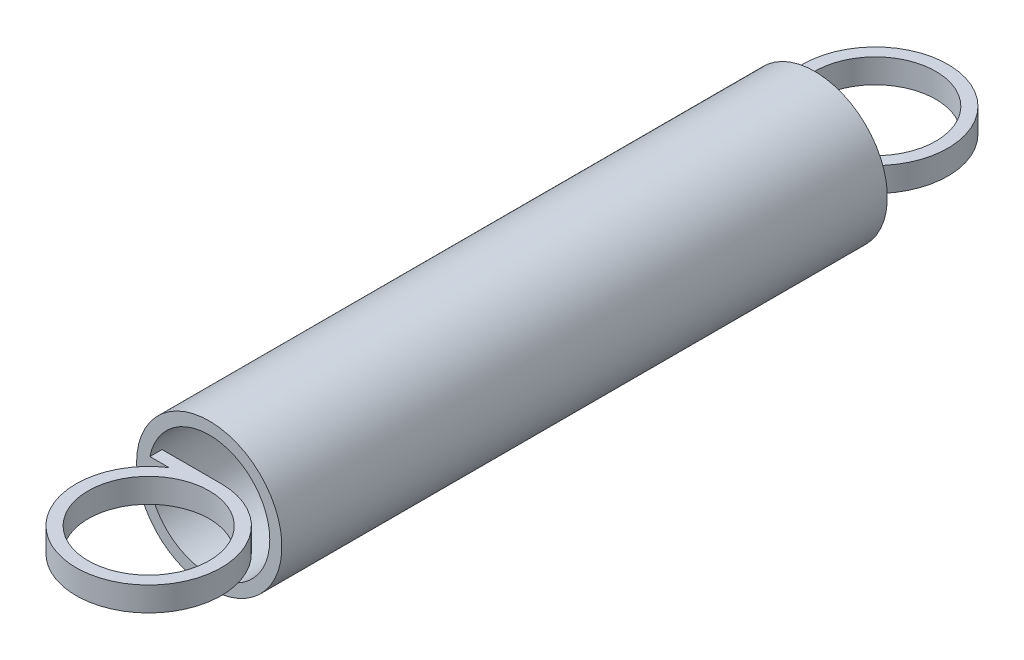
ISO-10303-21;
HEADER;
FILE_DESCRIPTION(('STEP AP214'),'2;1');
FILE_NAME('part.step','',(''),(''),'','','');
FILE_SCHEMA(('AUTOMOTIVE_DESIGN { 1 0 10303 214 1 1 1 1 }'));
ENDSEC;
DATA;
#1=APPLICATION_CONTEXT('core data for automotive mechanical design processes');
#2=APPLICATION_PROTOCOL_DEFINITION('international standard','automotive_design',2000,#1);
#3=PRODUCT_CONTEXT('',#1,'mechanical');
#4=PRODUCT('Part','Part','',(#3));
#5=PRODUCT_RELATED_PRODUCT_CATEGORY('part','',(#4));
#6=PRODUCT_DEFINITION_FORMATION('','',#4);
#7=PRODUCT_DEFINITION_CONTEXT('part definition',#1,'design');
#8=PRODUCT_DEFINITION('design','',#6,#7);
#9=PRODUCT_DEFINITION_SHAPE('','',#8);
#10=(LENGTH_UNIT() NAMED_UNIT(*) SI_UNIT(.MILLI.,.METRE.));
#11=(NAMED_UNIT(*) PLANE_ANGLE_UNIT() SI_UNIT($,.RADIAN.));
#12=(NAMED_UNIT(*) SI_UNIT($,.STERADIAN.) SOLID_ANGLE_UNIT());
#13=UNCERTAINTY_MEASURE_WITH_UNIT(LENGTH_MEASURE(1.E-05),#10,'distance_accuracy_value','');
#14=(GEOMETRIC_REPRESENTATION_CONTEXT(3) GLOBAL_UNCERTAINTY_ASSIGNED_CONTEXT((#13)) GLOBAL_UNIT_ASSIGNED_CONTEXT((#10,
#11,#12)) REPRESENTATION_CONTEXT('',''));
#15=CARTESIAN_POINT('',(0.,0.,0.));
#16=DIRECTION('',(0.,0.,1.));
#17=DIRECTION('',(1.,0.,0.));
#18=AXIS2_PLACEMENT_3D('',#15,#16,#17);
#19=CARTESIAN_POINT('',(0.,0.,12.5));
#20=DIRECTION('',(0.,0.,1.));
#21=DIRECTION('',(1.,0.,0.));
#22=AXIS2_PLACEMENT_3D('',#19,#20,#21);
#23=PLANE('',#22);
#24=DIRECTION('',(-1.,0.,0.));
#25=VECTOR('',#24,1.);
#26=CARTESIAN_POINT('',(-1.65831239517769,0.499999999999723,12.5));
#27=LINE('',#26,#25);
#28=CARTESIAN_POINT('',(-1.65831239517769,0.499999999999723,12.5));
#29=VERTEX_POINT('',#28);
#30=CARTESIAN_POINT('',(-2.44948974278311,0.499999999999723,12.4999999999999));
#31=VERTEX_POINT('',#30);
#32=EDGE_CURVE('E119',#29,#31,#27,.T.);
#33=ORIENTED_EDGE('',*,*,#32,.T.);
#34=CARTESIAN_POINT('',(0.,0.,12.5));
#35=DIRECTION('',(0.,0.,1.));
#36=DIRECTION('',(1.,0.,0.));
#37=AXIS2_PLACEMENT_3D('',#34,#35,#36);
#38=CIRCLE('',#37,2.5);
#39=CARTESIAN_POINT('',(-2.44948974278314,-0.499999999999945,12.5));
#40=VERTEX_POINT('',#39);
#41=EDGE_CURVE('E111',#40,#31,#38,.T.);
#42=ORIENTED_EDGE('',*,*,#41,.F.);
#43=DIRECTION('',(-1.,0.,0.));
#44=VECTOR('',#43,1.);
#45=CARTESIAN_POINT('',(-1.65831239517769,-0.499999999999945,12.5));
#46=LINE('',#45,#44);
#47=CARTESIAN_POINT('',(-1.65831239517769,-0.499999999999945,12.5));
#48=VERTEX_POINT('',#47);
#49=EDGE_CURVE('E45',#48,#40,#46,.T.);
#50=ORIENTED_EDGE('',*,*,#49,.F.);
#51=DIRECTION('',(0.,-1.,0.));
#52=VECTOR('',#51,1.);
#53=CARTESIAN_POINT('',(-1.65831239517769,0.499999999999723,12.5));
#54=LINE('',#53,#52);
#55=EDGE_CURVE('E96',#29,#48,#54,.T.);
#56=ORIENTED_EDGE('',*,*,#55,.F.);
#57=EDGE_LOOP('',(#33,#42,#50,#56));
#58=FACE_BOUND('',#57,.T.);
#59=CARTESIAN_POINT('',(0.,0.,12.5));
#60=DIRECTION('',(0.,0.,1.));
#61=DIRECTION('',(1.,0.,0.));
#62=AXIS2_PLACEMENT_3D('',#59,#60,#61);
#63=CIRCLE('',#62,3.);
#64=CARTESIAN_POINT('',(-2.99999999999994,0.,12.5));
#65=VERTEX_POINT('',#64);
#66=EDGE_CURVE('E159',#65,#65,#63,.T.);
#67=ORIENTED_EDGE('',*,*,#66,.T.);
#68=EDGE_LOOP('',(#67));
#69=FACE_BOUND('',#68,.T.);
#70=ADVANCED_FACE('F30',(#58,#69),#23,.T.);
#71=CARTESIAN_POINT('',(0.,0.,-12.5));
#72=DIRECTION('',(0.,0.,1.));
#73=DIRECTION('',(1.,0.,0.));
#74=AXIS2_PLACEMENT_3D('',#71,#72,#73);
#75=PLANE('',#74);
#76=CARTESIAN_POINT('',(0.,0.,-12.5));
#77=DIRECTION('',(0.,0.,1.));
#78=DIRECTION('',(1.,0.,0.));
#79=AXIS2_PLACEMENT_3D('',#76,#77,#78);
#80=CIRCLE('',#79,3.);
#81=CARTESIAN_POINT('',(-2.99999999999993,0.,-12.5));
#82=VERTEX_POINT('',#81);
#83=EDGE_CURVE('E156',#82,#82,#80,.T.);
#84=ORIENTED_EDGE('',*,*,#83,.F.);
#85=EDGE_LOOP('',(#84));
#86=FACE_BOUND('',#85,.T.);
#87=CARTESIAN_POINT('',(0.,0.,-12.5));
#88=DIRECTION('',(0.,0.,1.));
#89=DIRECTION('',(1.,0.,0.));
#90=AXIS2_PLACEMENT_3D('',#87,#88,#89);
#91=CIRCLE('',#90,2.5);
#92=CARTESIAN_POINT('',(-2.44948974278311,-0.500000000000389,-12.5000000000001));
#93=VERTEX_POINT('',#92);
#94=CARTESIAN_POINT('',(-2.4494897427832,0.499999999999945,-12.5));
#95=VERTEX_POINT('',#94);
#96=EDGE_CURVE('E153',#93,#95,#91,.T.);
#97=ORIENTED_EDGE('',*,*,#96,.T.);
#98=DIRECTION('',(-1.,0.,0.));
#99=VECTOR('',#98,1.);
#100=CARTESIAN_POINT('',(-1.65831239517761,0.500000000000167,-12.5000000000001));
#101=LINE('',#100,#99);
#102=CARTESIAN_POINT('',(-1.65831239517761,0.500000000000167,-12.5000000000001));
#103=VERTEX_POINT('',#102);
#104=EDGE_CURVE('E147',#103,#95,#101,.T.);
#105=ORIENTED_EDGE('',*,*,#104,.F.);
#106=DIRECTION('',(0.,-1.,0.));
#107=VECTOR('',#106,1.);
#108=CARTESIAN_POINT('',(-1.65831239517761,0.500000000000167,-12.5000000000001));
#109=LINE('',#108,#107);
#110=CARTESIAN_POINT('',(-1.65831239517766,-0.500000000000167,-12.5000000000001));
#111=VERTEX_POINT('',#110);
#112=EDGE_CURVE('E149',#103,#111,#109,.T.);
#113=ORIENTED_EDGE('',*,*,#112,.T.);
#114=DIRECTION('',(-1.,0.,0.));
#115=VECTOR('',#114,1.);
#116=CARTESIAN_POINT('',(-1.65831239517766,-0.500000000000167,-12.5000000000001));
#117=LINE('',#116,#115);
#118=EDGE_CURVE('E53',#111,#93,#117,.T.);
#119=ORIENTED_EDGE('',*,*,#118,.T.);
#120=EDGE_LOOP('',(#97,#105,#113,#119));
#121=FACE_BOUND('',#120,.T.);
#122=ADVANCED_FACE('F195',(#86,#121),#75,.F.);
#123=CARTESIAN_POINT('',(0.,0.,12.5));
#124=DIRECTION('',(0.,0.,-1.));
#125=DIRECTION('',(-1.,0.,0.));
#126=AXIS2_PLACEMENT_3D('',#123,#124,#125);
#127=CYLINDRICAL_SURFACE('',#126,3.);
#128=CARTESIAN_POINT('',(-2.99999999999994,0.,12.5));
#129=CARTESIAN_POINT('',(-2.99999999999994,0.,12.2395833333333));
#130=CARTESIAN_POINT('',(-2.99999999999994,0.,11.9791666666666));
#131=CARTESIAN_POINT('',(-2.99999999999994,0.,11.4583333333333));
#132=CARTESIAN_POINT('',(-2.99999999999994,0.,11.1979166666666));
#133=CARTESIAN_POINT('',(-2.99999999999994,0.,10.6770833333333));
#134=CARTESIAN_POINT('',(-2.99999999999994,0.,10.4166666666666));
#135=CARTESIAN_POINT('',(-2.99999999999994,0.,9.89583333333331));
#136=CARTESIAN_POINT('',(-2.99999999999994,0.,9.63541666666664));
#137=CARTESIAN_POINT('',(-2.99999999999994,0.,9.11458333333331));
#138=CARTESIAN_POINT('',(-2.99999999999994,0.,8.85416666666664));
#139=CARTESIAN_POINT('',(-2.99999999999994,0.,8.33333333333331));
#140=CARTESIAN_POINT('',(-2.99999999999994,0.,8.07291666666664));
#141=CARTESIAN_POINT('',(-2.99999999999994,0.,7.55208333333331));
#142=CARTESIAN_POINT('',(-2.99999999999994,0.,7.29166666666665));
#143=CARTESIAN_POINT('',(-2.99999999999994,0.,6.77083333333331));
#144=CARTESIAN_POINT('',(-2.99999999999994,0.,6.51041666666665));
#145=CARTESIAN_POINT('',(-2.99999999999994,0.,5.98958333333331));
#146=CARTESIAN_POINT('',(-2.99999999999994,0.,5.72916666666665));
#147=CARTESIAN_POINT('',(-2.99999999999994,0.,5.20833333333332));
#148=CARTESIAN_POINT('',(-2.99999999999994,0.,4.94791666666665));
#149=CARTESIAN_POINT('',(-2.99999999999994,0.,4.42708333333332));
#150=CARTESIAN_POINT('',(-2.99999999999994,0.,4.16666666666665));
#151=CARTESIAN_POINT('',(-2.99999999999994,0.,3.64583333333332));
#152=CARTESIAN_POINT('',(-2.99999999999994,0.,3.38541666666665));
#153=CARTESIAN_POINT('',(-2.99999999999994,0.,2.86458333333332));
#154=CARTESIAN_POINT('',(-2.99999999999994,0.,2.60416666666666));
#155=CARTESIAN_POINT('',(-2.99999999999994,0.,2.08333333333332));
#156=CARTESIAN_POINT('',(-2.99999999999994,0.,1.82291666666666));
#157=CARTESIAN_POINT('',(-2.99999999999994,0.,1.30208333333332));
#158=CARTESIAN_POINT('',(-2.99999999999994,0.,1.04166666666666));
#159=CARTESIAN_POINT('',(-2.99999999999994,0.,0.520833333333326));
#160=CARTESIAN_POINT('',(-2.99999999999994,0.,0.260416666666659));
#161=CARTESIAN_POINT('',(-2.99999999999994,0.,-0.260416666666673));
#162=CARTESIAN_POINT('',(-2.99999999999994,0.,-0.520833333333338));
#163=CARTESIAN_POINT('',(-2.99999999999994,0.,-1.04166666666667));
#164=CARTESIAN_POINT('',(-2.99999999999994,0.,-1.30208333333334));
#165=CARTESIAN_POINT('',(-2.99999999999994,0.,-1.82291666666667));
#166=CARTESIAN_POINT('',(-2.99999999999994,0.,-2.08333333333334));
#167=CARTESIAN_POINT('',(-2.99999999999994,0.,-2.60416666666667));
#168=CARTESIAN_POINT('',(-2.99999999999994,0.,-2.86458333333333));
#169=CARTESIAN_POINT('',(-2.99999999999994,0.,-3.38541666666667));
#170=CARTESIAN_POINT('',(-2.99999999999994,0.,-3.64583333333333));
#171=CARTESIAN_POINT('',(-2.99999999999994,0.,-4.16666666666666));
#172=CARTESIAN_POINT('',(-2.99999999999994,0.,-4.42708333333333));
#173=CARTESIAN_POINT('',(-2.99999999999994,0.,-4.94791666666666));
#174=CARTESIAN_POINT('',(-2.99999999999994,0.,-5.20833333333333));
#175=CARTESIAN_POINT('',(-2.99999999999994,0.,-5.72916666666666));
#176=CARTESIAN_POINT('',(-2.99999999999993,0.,-5.98958333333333));
#177=CARTESIAN_POINT('',(-2.99999999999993,0.,-6.51041666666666));
#178=CARTESIAN_POINT('',(-2.99999999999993,0.,-6.77083333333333));
#179=CARTESIAN_POINT('',(-2.99999999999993,0.,-7.29166666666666));
#180=CARTESIAN_POINT('',(-2.99999999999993,0.,-7.55208333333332));
#181=CARTESIAN_POINT('',(-2.99999999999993,0.,-8.07291666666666));
#182=CARTESIAN_POINT('',(-2.99999999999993,0.,-8.33333333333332));
#183=CARTESIAN_POINT('',(-2.99999999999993,0.,-8.85416666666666));
#184=CARTESIAN_POINT('',(-2.99999999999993,0.,-9.11458333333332));
#185=CARTESIAN_POINT('',(-2.99999999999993,0.,-9.63541666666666));
#186=CARTESIAN_POINT('',(-2.99999999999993,0.,-9.89583333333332));
#187=CARTESIAN_POINT('',(-2.99999999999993,0.,-10.4166666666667));
#188=CARTESIAN_POINT('',(-2.99999999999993,0.,-10.6770833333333));
#189=CARTESIAN_POINT('',(-2.99999999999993,0.,-11.1979166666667));
#190=CARTESIAN_POINT('',(-2.99999999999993,0.,-11.4583333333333));
#191=CARTESIAN_POINT('',(-2.99999999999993,0.,-11.9791666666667));
#192=CARTESIAN_POINT('',(-2.99999999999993,0.,-12.2395833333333));
#193=CARTESIAN_POINT('',(-2.99999999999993,0.,-12.5));
#194=B_SPLINE_CURVE_WITH_KNOTS('',3,(#128,#129,#130,#131,#132,#133,#134,#135,#136,#137,#138,
#139,#140,#141,#142,#143,#144,#145,#146,#147,#148,#149,#150,#151,#152,#153,#154,#155,#156,#157,
#158,#159,#160,#161,#162,#163,#164,#165,#166,#167,#168,#169,#170,#171,#172,#173,#174,#175,#176,
#177,#178,#179,#180,#181,#182,#183,#184,#185,#186,#187,#188,#189,#190,#191,#192,#193),
.UNSPECIFIED.,.F.,.F.,(4,2,2,2,2,2,2,2,2,2,2,2,2,2,2,2,2,2,2,2,2,2,2,2,2,2,2,2,2,2,2,2,4),(0.,
0.781249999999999,1.5625,2.34375,3.125,3.90624999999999,4.68749999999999,5.46874999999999,
6.24999999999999,7.03124999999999,7.81249999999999,8.59374999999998,9.37499999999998,10.15625,
10.9375,11.71875,12.5,13.28125,14.0625,14.84375,15.625,16.40625,17.1875,17.96875,18.75,19.53125,
20.3125,21.09375,21.875,22.65625,23.4375,24.21875,25.),.UNSPECIFIED.);
#195=EDGE_CURVE('BSEAM32',#65,#82,#194,.T.);
#196=ORIENTED_EDGE('',*,*,#66,.F.);
#197=ORIENTED_EDGE('',*,*,#83,.T.);
#198=ORIENTED_EDGE('',*,*,#195,.T.);
#199=ORIENTED_EDGE('',*,*,#195,.F.);
#200=EDGE_LOOP('',(#196,#198,#197,#199));
#201=FACE_BOUND('',#200,.T.);
#202=ADVANCED_FACE('F32',(#201),#127,.T.);
#203=CARTESIAN_POINT('',(0.,0.,12.5));
#204=DIRECTION('',(0.,0.,-1.));
#205=DIRECTION('',(-1.,0.,0.));
#206=AXIS2_PLACEMENT_3D('',#203,#204,#205);
#207=CYLINDRICAL_SURFACE('',#206,2.5);
#208=DIRECTION('',(0.,0.,-1.));
#209=VECTOR('',#208,1.);
#210=CARTESIAN_POINT('',(-2.44948974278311,0.499999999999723,12.4999999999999));
#211=LINE('',#210,#209);
#212=CARTESIAN_POINT('',(-2.4494897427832,0.499999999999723,12.));
#213=VERTEX_POINT('',#212);
#214=EDGE_CURVE('E11',#213,#31,#211,.F.);
#215=ORIENTED_EDGE('',*,*,#214,.F.);
#216=CARTESIAN_POINT('',(0.,-2.22044604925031E-13,12.));
#217=DIRECTION('',(0.,0.,1.));
#218=DIRECTION('',(1.,0.,0.));
#219=AXIS2_PLACEMENT_3D('',#216,#217,#218);
#220=CIRCLE('',#219,2.5);
#221=CARTESIAN_POINT('',(-2.44948974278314,-0.499999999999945,12.));
#222=VERTEX_POINT('',#221);
#223=EDGE_CURVE('E38',#213,#222,#220,.T.);
#224=ORIENTED_EDGE('',*,*,#223,.T.);
#225=DIRECTION('',(0.,0.,-1.));
#226=VECTOR('',#225,1.);
#227=CARTESIAN_POINT('',(-2.44948974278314,-0.499999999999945,12.5));
#228=LINE('',#227,#226);
#229=EDGE_CURVE('E169',#222,#40,#228,.F.);
#230=ORIENTED_EDGE('',*,*,#229,.T.);
#231=ORIENTED_EDGE('',*,*,#41,.T.);
#232=EDGE_LOOP('',(#215,#224,#230,#231));
#233=FACE_BOUND('',#232,.T.);
#234=DIRECTION('',(0.,0.,-1.));
#235=VECTOR('',#234,1.);
#236=CARTESIAN_POINT('',(-2.44948974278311,0.499999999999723,12.4999999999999));
#237=LINE('',#236,#235);
#238=CARTESIAN_POINT('',(-2.44948974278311,0.499999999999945,-12.0000000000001));
#239=VERTEX_POINT('',#238);
#240=EDGE_CURVE('E167',#95,#239,#237,.F.);
#241=ORIENTED_EDGE('',*,*,#240,.F.);
#242=ORIENTED_EDGE('',*,*,#96,.F.);
#243=DIRECTION('',(0.,0.,-1.));
#244=VECTOR('',#243,1.);
#245=CARTESIAN_POINT('',(-2.44948974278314,-0.499999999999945,12.5));
#246=LINE('',#245,#244);
#247=CARTESIAN_POINT('',(-2.44948974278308,-0.500000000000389,-12.0000000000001));
#248=VERTEX_POINT('',#247);
#249=EDGE_CURVE('E164',#93,#248,#246,.F.);
#250=ORIENTED_EDGE('',*,*,#249,.T.);
#251=CARTESIAN_POINT('',(0.,0.,-12.));
#252=DIRECTION('',(0.,0.,1.));
#253=DIRECTION('',(1.,0.,0.));
#254=AXIS2_PLACEMENT_3D('',#251,#252,#253);
#255=CIRCLE('',#254,2.5);
#256=EDGE_CURVE('E162',#239,#248,#255,.T.);
#257=ORIENTED_EDGE('',*,*,#256,.F.);
#258=EDGE_LOOP('',(#241,#242,#250,#257));
#259=FACE_BOUND('',#258,.T.);
#260=ADVANCED_FACE('F173',(#233,#259),#207,.F.);
#261=CARTESIAN_POINT('',(0.,0.500000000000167,-15.));
#262=DIRECTION('',(0.,1.,0.));
#263=DIRECTION('',(0.,0.,1.));
#264=AXIS2_PLACEMENT_3D('',#261,#262,#263);
#265=PLANE('',#264);
#266=ORIENTED_EDGE('',*,*,#104,.T.);
#267=ORIENTED_EDGE('',*,*,#240,.T.);
#268=DIRECTION('',(-1.,0.,0.));
#269=VECTOR('',#268,1.);
#270=CARTESIAN_POINT('',(0.,0.500000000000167,-12.0000000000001));
#271=LINE('',#270,#269);
#272=CARTESIAN_POINT('',(0.,0.500000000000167,-12.0000000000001));
#273=VERTEX_POINT('',#272);
#274=EDGE_CURVE('E141',#273,#239,#271,.T.);
#275=ORIENTED_EDGE('',*,*,#274,.F.);
#276=CARTESIAN_POINT('',(0.,0.500000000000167,-15.));
#277=DIRECTION('',(0.,1.,0.));
#278=DIRECTION('',(0.,0.,1.));
#279=AXIS2_PLACEMENT_3D('',#276,#277,#278);
#280=CIRCLE('',#279,3.);
#281=EDGE_CURVE('E144',#273,#103,#280,.T.);
#282=ORIENTED_EDGE('',*,*,#281,.T.);
#283=EDGE_LOOP('',(#266,#267,#275,#282));
#284=FACE_BOUND('',#283,.T.);
#285=CARTESIAN_POINT('',(0.,0.500000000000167,-15.));
#286=DIRECTION('',(0.,1.,0.));
#287=DIRECTION('',(0.,0.,1.));
#288=AXIS2_PLACEMENT_3D('',#285,#286,#287);
#289=CIRCLE('',#288,2.5);
#290=CARTESIAN_POINT('',(0.,0.500000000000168,-12.5));
#291=VERTEX_POINT('',#290);
#292=EDGE_CURVE('E131',#291,#291,#289,.T.);
#293=ORIENTED_EDGE('',*,*,#292,.F.);
#294=EDGE_LOOP('',(#293));
#295=FACE_BOUND('',#294,.T.);
#296=ADVANCED_FACE('F204',(#284,#295),#265,.T.);
#297=CARTESIAN_POINT('',(0.,-0.500000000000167,-15.0000000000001));
#298=DIRECTION('',(0.,1.,0.));
#299=DIRECTION('',(0.,0.,1.));
#300=AXIS2_PLACEMENT_3D('',#297,#298,#299);
#301=PLANE('',#300);
#302=ORIENTED_EDGE('',*,*,#249,.F.);
#303=ORIENTED_EDGE('',*,*,#118,.F.);
#304=CARTESIAN_POINT('',(0.,-0.500000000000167,-15.0000000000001));
#305=DIRECTION('',(0.,1.,0.));
#306=DIRECTION('',(0.,0.,1.));
#307=AXIS2_PLACEMENT_3D('',#304,#305,#306);
#308=CIRCLE('',#307,3.);
#309=CARTESIAN_POINT('',(0.,-0.500000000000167,-12.0000000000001));
#310=VERTEX_POINT('',#309);
#311=EDGE_CURVE('E137',#310,#111,#308,.T.);
#312=ORIENTED_EDGE('',*,*,#311,.F.);
#313=DIRECTION('',(-1.,0.,0.));
#314=VECTOR('',#313,1.);
#315=CARTESIAN_POINT('',(0.,-0.500000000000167,-12.0000000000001));
#316=LINE('',#315,#314);
#317=EDGE_CURVE('E134',#310,#248,#316,.T.);
#318=ORIENTED_EDGE('',*,*,#317,.T.);
#319=EDGE_LOOP('',(#302,#303,#312,#318));
#320=FACE_BOUND('',#319,.T.);
#321=CARTESIAN_POINT('',(0.,-0.500000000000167,-15.0000000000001));
#322=DIRECTION('',(0.,1.,0.));
#323=DIRECTION('',(0.,0.,1.));
#324=AXIS2_PLACEMENT_3D('',#321,#322,#323);
#325=CIRCLE('',#324,2.5);
#326=CARTESIAN_POINT('',(0.,-0.500000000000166,-12.5000000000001));
#327=VERTEX_POINT('',#326);
#328=EDGE_CURVE('E105',#327,#327,#325,.T.);
#329=ORIENTED_EDGE('',*,*,#328,.T.);
#330=EDGE_LOOP('',(#329));
#331=FACE_BOUND('',#330,.T.);
#332=ADVANCED_FACE('F209',(#320,#331),#301,.F.);
#333=CARTESIAN_POINT('',(0.,0.500000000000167,-12.0000000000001));
#334=DIRECTION('',(0.,0.,1.));
#335=DIRECTION('',(1.,0.,0.));
#336=AXIS2_PLACEMENT_3D('',#333,#334,#335);
#337=PLANE('',#336);
#338=ORIENTED_EDGE('',*,*,#274,.T.);
#339=ORIENTED_EDGE('',*,*,#256,.T.);
#340=ORIENTED_EDGE('',*,*,#317,.F.);
#341=DIRECTION('',(0.,-1.,0.));
#342=VECTOR('',#341,1.);
#343=CARTESIAN_POINT('',(0.,0.500000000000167,-12.0000000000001));
#344=LINE('',#343,#342);
#345=EDGE_CURVE('E151',#273,#310,#344,.T.);
#346=ORIENTED_EDGE('',*,*,#345,.F.);
#347=EDGE_LOOP('',(#338,#339,#340,#346));
#348=FACE_BOUND('',#347,.T.);
#349=ADVANCED_FACE('F205',(#348),#337,.T.);
#350=CARTESIAN_POINT('',(0.,0.500000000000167,-15.));
#351=DIRECTION('',(0.,-1.,0.));
#352=DIRECTION('',(0.,0.,-1.));
#353=AXIS2_PLACEMENT_3D('',#350,#351,#352);
#354=CYLINDRICAL_SURFACE('',#353,3.);
#355=ORIENTED_EDGE('',*,*,#112,.F.);
#356=ORIENTED_EDGE('',*,*,#281,.F.);
#357=ORIENTED_EDGE('',*,*,#345,.T.);
#358=ORIENTED_EDGE('',*,*,#311,.T.);
#359=EDGE_LOOP('',(#355,#356,#357,#358));
#360=FACE_BOUND('',#359,.T.);
#361=ADVANCED_FACE('F208',(#360),#354,.T.);
#362=CARTESIAN_POINT('',(0.,0.500000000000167,-15.));
#363=DIRECTION('',(0.,-1.,0.));
#364=DIRECTION('',(0.,0.,-1.));
#365=AXIS2_PLACEMENT_3D('',#362,#363,#364);
#366=CYLINDRICAL_SURFACE('',#365,2.5);
#367=ORIENTED_EDGE('',*,*,#292,.T.);
#368=EDGE_LOOP('',(#367));
#369=FACE_BOUND('',#368,.T.);
#370=ORIENTED_EDGE('',*,*,#328,.F.);
#371=EDGE_LOOP('',(#370));
#372=FACE_BOUND('',#371,.T.);
#373=ADVANCED_FACE('F192',(#369,#372),#366,.F.);
#374=CARTESIAN_POINT('',(0.,0.499999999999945,14.9999999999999));
#375=DIRECTION('',(0.,-1.,0.));
#376=DIRECTION('',(0.,0.,-1.));
#377=AXIS2_PLACEMENT_3D('',#374,#375,#376);
#378=CYLINDRICAL_SURFACE('',#377,3.);
#379=DIRECTION('',(0.,-1.,0.));
#380=VECTOR('',#379,1.);
#381=CARTESIAN_POINT('',(0.,0.499999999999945,12.));
#382=LINE('',#381,#380);
#383=CARTESIAN_POINT('',(0.,0.499999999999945,12.));
#384=VERTEX_POINT('',#383);
#385=CARTESIAN_POINT('',(0.,-0.500000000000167,12.));
#386=VERTEX_POINT('',#385);
#387=EDGE_CURVE('E106',#384,#386,#382,.T.);
#388=ORIENTED_EDGE('',*,*,#387,.F.);
#389=CARTESIAN_POINT('',(0.,0.499999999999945,14.9999999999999));
#390=DIRECTION('',(0.,-1.,0.));
#391=DIRECTION('',(0.,0.,-1.));
#392=AXIS2_PLACEMENT_3D('',#389,#390,#391);
#393=CIRCLE('',#392,3.);
#394=EDGE_CURVE('E101',#384,#29,#393,.T.);
#395=ORIENTED_EDGE('',*,*,#394,.T.);
#396=ORIENTED_EDGE('',*,*,#55,.T.);
#397=CARTESIAN_POINT('',(0.,-0.500000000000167,15.));
#398=DIRECTION('',(0.,-1.,0.));
#399=DIRECTION('',(0.,0.,-1.));
#400=AXIS2_PLACEMENT_3D('',#397,#398,#399);
#401=CIRCLE('',#400,3.);
#402=EDGE_CURVE('E98',#386,#48,#401,.T.);
#403=ORIENTED_EDGE('',*,*,#402,.F.);
#404=EDGE_LOOP('',(#388,#395,#396,#403));
#405=FACE_BOUND('',#404,.T.);
#406=ADVANCED_FACE('F97',(#405),#378,.T.);
#407=CARTESIAN_POINT('',(0.,0.499999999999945,12.));
#408=DIRECTION('',(0.,0.,1.));
#409=DIRECTION('',(1.,0.,0.));
#410=AXIS2_PLACEMENT_3D('',#407,#408,#409);
#411=PLANE('',#410);
#412=ORIENTED_EDGE('',*,*,#223,.F.);
#413=DIRECTION('',(-1.,0.,0.));
#414=VECTOR('',#413,1.);
#415=CARTESIAN_POINT('',(0.,0.499999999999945,12.));
#416=LINE('',#415,#414);
#417=EDGE_CURVE('E125',#384,#213,#416,.T.);
#418=ORIENTED_EDGE('',*,*,#417,.F.);
#419=ORIENTED_EDGE('',*,*,#387,.T.);
#420=DIRECTION('',(-1.,0.,0.));
#421=VECTOR('',#420,1.);
#422=CARTESIAN_POINT('',(0.,-0.500000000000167,12.));
#423=LINE('',#422,#421);
#424=EDGE_CURVE('E117',#386,#222,#423,.T.);
#425=ORIENTED_EDGE('',*,*,#424,.T.);
#426=EDGE_LOOP('',(#412,#418,#419,#425));
#427=FACE_BOUND('',#426,.T.);
#428=ADVANCED_FACE('F177',(#427),#411,.F.);
#429=CARTESIAN_POINT('',(0.,0.499999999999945,14.9999999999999));
#430=DIRECTION('',(0.,1.,0.));
#431=DIRECTION('',(0.,0.,-1.));
#432=AXIS2_PLACEMENT_3D('',#429,#430,#431);
#433=PLANE('',#432);
#434=CARTESIAN_POINT('',(0.,0.499999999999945,14.9999999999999));
#435=DIRECTION('',(0.,-1.,0.));
#436=DIRECTION('',(0.,0.,-1.));
#437=AXIS2_PLACEMENT_3D('',#434,#435,#436);
#438=CIRCLE('',#437,2.5);
#439=CARTESIAN_POINT('',(0.,0.499999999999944,12.4999999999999));
#440=VERTEX_POINT('',#439);
#441=EDGE_CURVE('E112',#440,#440,#438,.T.);
#442=ORIENTED_EDGE('',*,*,#441,.T.);
#443=EDGE_LOOP('',(#442));
#444=FACE_BOUND('',#443,.T.);
#445=ORIENTED_EDGE('',*,*,#417,.T.);
#446=ORIENTED_EDGE('',*,*,#214,.T.);
#447=ORIENTED_EDGE('',*,*,#32,.F.);
#448=ORIENTED_EDGE('',*,*,#394,.F.);
#449=EDGE_LOOP('',(#445,#446,#447,#448));
#450=FACE_BOUND('',#449,.T.);
#451=ADVANCED_FACE('F179',(#444,#450),#433,.T.);
#452=CARTESIAN_POINT('',(0.,-0.500000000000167,15.));
#453=DIRECTION('',(0.,1.,0.));
#454=DIRECTION('',(0.,0.,-1.));
#455=AXIS2_PLACEMENT_3D('',#452,#453,#454);
#456=PLANE('',#455);
#457=ORIENTED_EDGE('',*,*,#229,.F.);
#458=ORIENTED_EDGE('',*,*,#424,.F.);
#459=ORIENTED_EDGE('',*,*,#402,.T.);
#460=ORIENTED_EDGE('',*,*,#49,.T.);
#461=EDGE_LOOP('',(#457,#458,#459,#460));
#462=FACE_BOUND('',#461,.T.);
#463=CARTESIAN_POINT('',(0.,-0.500000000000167,15.));
#464=DIRECTION('',(0.,-1.,0.));
#465=DIRECTION('',(0.,0.,-1.));
#466=AXIS2_PLACEMENT_3D('',#463,#464,#465);
#467=CIRCLE('',#466,2.5);
#468=CARTESIAN_POINT('',(0.,-0.500000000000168,12.5));
#469=VERTEX_POINT('',#468);
#470=EDGE_CURVE('E266',#469,#469,#467,.T.);
#471=ORIENTED_EDGE('',*,*,#470,.F.);
#472=EDGE_LOOP('',(#471));
#473=FACE_BOUND('',#472,.T.);
#474=ADVANCED_FACE('F114',(#462,#473),#456,.F.);
#475=CARTESIAN_POINT('',(0.,0.499999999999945,14.9999999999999));
#476=DIRECTION('',(0.,-1.,0.));
#477=DIRECTION('',(0.,0.,-1.));
#478=AXIS2_PLACEMENT_3D('',#475,#476,#477);
#479=CYLINDRICAL_SURFACE('',#478,2.5);
#480=ORIENTED_EDGE('',*,*,#441,.F.);
#481=EDGE_LOOP('',(#480));
#482=FACE_BOUND('',#481,.T.);
#483=ORIENTED_EDGE('',*,*,#470,.T.);
#484=EDGE_LOOP('',(#483));
#485=FACE_BOUND('',#484,.T.);
#486=ADVANCED_FACE('F187',(#482,#485),#479,.F.);
#487=CLOSED_SHELL('',(#70,#122,#202,#260,#296,#332,#349,#361,#373,#406,#428,#451,#474,#486));
#488=MANIFOLD_SOLID_BREP('B2',#487);
#489=ADVANCED_BREP_SHAPE_REPRESENTATION('',(#18,#488),#14);
#490=SHAPE_DEFINITION_REPRESENTATION(#9,#489);
ENDSEC;
END-ISO-10303-21;
